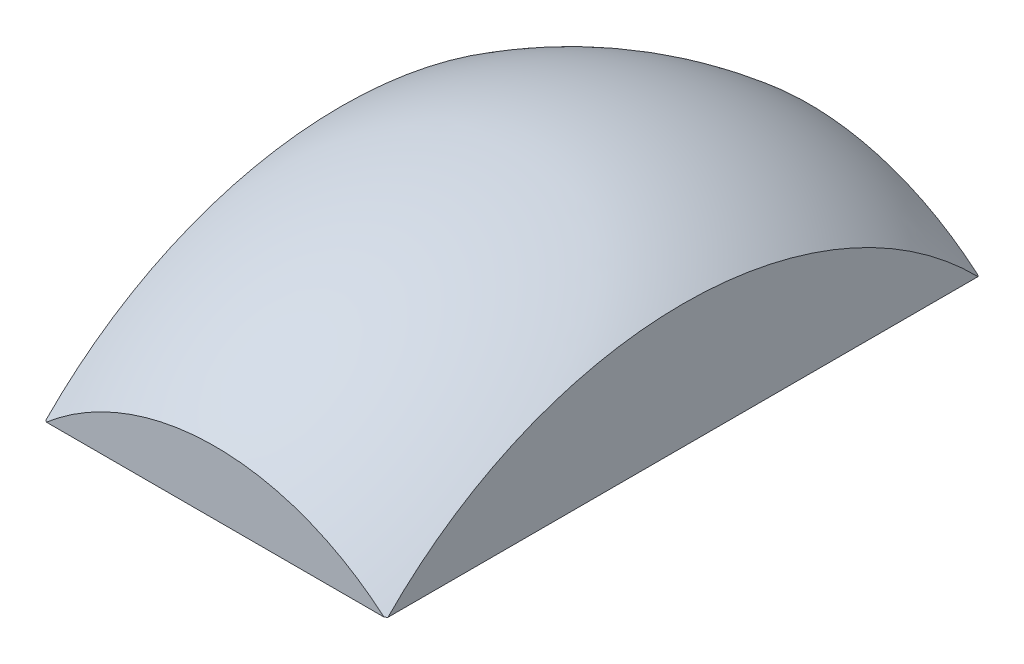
ISO-10303-21;
HEADER;
FILE_DESCRIPTION(('STEP AP214'),'2;1');
FILE_NAME('part.step','',(''),(''),'','','');
FILE_SCHEMA(('AUTOMOTIVE_DESIGN { 1 0 10303 214 1 1 1 1 }'));
ENDSEC;
DATA;
#1=APPLICATION_CONTEXT('core data for automotive mechanical design processes');
#2=APPLICATION_PROTOCOL_DEFINITION('international standard','automotive_design',2000,#1);
#3=PRODUCT_CONTEXT('',#1,'mechanical');
#4=PRODUCT('Part','Part','',(#3));
#5=PRODUCT_RELATED_PRODUCT_CATEGORY('part','',(#4));
#6=PRODUCT_DEFINITION_FORMATION('','',#4);
#7=PRODUCT_DEFINITION_CONTEXT('part definition',#1,'design');
#8=PRODUCT_DEFINITION('design','',#6,#7);
#9=PRODUCT_DEFINITION_SHAPE('','',#8);
#10=(LENGTH_UNIT() NAMED_UNIT(*) SI_UNIT(.MILLI.,.METRE.));
#11=(NAMED_UNIT(*) PLANE_ANGLE_UNIT() SI_UNIT($,.RADIAN.));
#12=(NAMED_UNIT(*) SI_UNIT($,.STERADIAN.) SOLID_ANGLE_UNIT());
#13=UNCERTAINTY_MEASURE_WITH_UNIT(LENGTH_MEASURE(1.E-05),#10,'distance_accuracy_value','');
#14=(GEOMETRIC_REPRESENTATION_CONTEXT(3) GLOBAL_UNCERTAINTY_ASSIGNED_CONTEXT((#13)) GLOBAL_UNIT_ASSIGNED_CONTEXT((#10,
#11,#12)) REPRESENTATION_CONTEXT('',''));
#15=CARTESIAN_POINT('',(0.,0.,0.));
#16=DIRECTION('',(0.,0.,1.));
#17=DIRECTION('',(1.,0.,0.));
#18=AXIS2_PLACEMENT_3D('',#15,#16,#17);
#19=CARTESIAN_POINT('',(-62.5,65.,108.5));
#20=DIRECTION('',(1.,0.,0.));
#21=DIRECTION('',(0.,1.,0.));
#22=AXIS2_PLACEMENT_3D('',#19,#20,#21);
#23=PLANE('',#22);
#24=CARTESIAN_POINT('',(-62.5,-105.625412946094,0.));
#25=DIRECTION('',(1.,0.,0.));
#26=DIRECTION('',(0.,0.,-1.));
#27=AXIS2_PLACEMENT_3D('',#24,#25,#26);
#28=CIRCLE('',#27,150.969374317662);
#29=CARTESIAN_POINT('',(-62.5,0.,-107.865768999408));
#30=VERTEX_POINT('',#29);
#31=CARTESIAN_POINT('',(-62.5,0.,107.865768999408));
#32=VERTEX_POINT('',#31);
#33=EDGE_CURVE('E57',#30,#32,#28,.T.);
#34=ORIENTED_EDGE('',*,*,#33,.F.);
#35=DIRECTION('',(0.,0.,-1.));
#36=VECTOR('',#35,1.);
#37=CARTESIAN_POINT('',(-62.5,0.,108.5));
#38=LINE('',#37,#36);
#39=EDGE_CURVE('E44',#32,#30,#38,.T.);
#40=ORIENTED_EDGE('',*,*,#39,.F.);
#41=EDGE_LOOP('',(#34,#40));
#42=FACE_BOUND('',#41,.T.);
#43=ADVANCED_FACE('F32',(#42),#23,.F.);
#44=CARTESIAN_POINT('',(-62.5,0.,108.5));
#45=DIRECTION('',(0.,1.,0.));
#46=DIRECTION('',(0.,0.,1.));
#47=AXIS2_PLACEMENT_3D('',#44,#45,#46);
#48=PLANE('',#47);
#49=CARTESIAN_POINT('',(105.910426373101,0.,0.));
#50=CARTESIAN_POINT('',(105.910428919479,0.,-2.38813620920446));
#51=CARTESIAN_POINT('',(105.866166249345,0.,-4.77629874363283));
#52=CARTESIAN_POINT('',(105.688526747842,0.,-9.54935461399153));
#53=CARTESIAN_POINT('',(105.555148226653,0.,-11.9342478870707));
#54=CARTESIAN_POINT('',(105.197502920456,0.,-16.6977261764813));
#55=CARTESIAN_POINT('',(104.973217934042,0.,-19.07630983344));
#56=CARTESIAN_POINT('',(104.431020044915,0.,-23.8227994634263));
#57=CARTESIAN_POINT('',(104.113108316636,0.,-26.1907055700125));
#58=CARTESIAN_POINT('',(103.381059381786,0.,-30.9053758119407));
#59=CARTESIAN_POINT('',(102.967173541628,0.,-33.2521788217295));
#60=CARTESIAN_POINT('',(102.038654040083,0.,-37.925909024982));
#61=CARTESIAN_POINT('',(101.524017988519,0.,-40.2528357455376));
#62=CARTESIAN_POINT('',(100.38992578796,0.,-44.8800449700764));
#63=CARTESIAN_POINT('',(99.7705133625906,0.,-47.1803381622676));
#64=CARTESIAN_POINT('',(98.4224536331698,0.,-51.7486330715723));
#65=CARTESIAN_POINT('',(97.6938166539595,0.,-54.0166378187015));
#66=CARTESIAN_POINT('',(96.3564117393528,0.,-57.8458057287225));
#67=CARTESIAN_POINT('',(95.7762364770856,0.,-59.4170031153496));
#68=CARTESIAN_POINT('',(94.5586879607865,0.,-62.5370632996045));
#69=CARTESIAN_POINT('',(93.9213170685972,0.,-64.0859270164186));
#70=CARTESIAN_POINT('',(92.5883669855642,0.,-67.1582744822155));
#71=CARTESIAN_POINT('',(91.8927924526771,0.,-68.6817602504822));
#72=CARTESIAN_POINT('',(90.4425352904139,0.,-71.7003866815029));
#73=CARTESIAN_POINT('',(89.6878520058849,0.,-73.1955270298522));
#74=CARTESIAN_POINT('',(88.1189412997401,0.,-76.1538677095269));
#75=CARTESIAN_POINT('',(87.3047261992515,0.,-77.6170745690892));
#76=CARTESIAN_POINT('',(85.6162943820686,0.,-80.5084355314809));
#77=CARTESIAN_POINT('',(84.7420790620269,0.,-81.9365904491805));
#78=CARTESIAN_POINT('',(82.9335280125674,0.,-84.7544537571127));
#79=CARTESIAN_POINT('',(81.9991890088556,0.,-86.1441600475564));
#80=CARTESIAN_POINT('',(80.0706843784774,0.,-88.8814576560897));
#81=CARTESIAN_POINT('',(79.0765186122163,0.,-90.2290488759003));
#82=CARTESIAN_POINT('',(77.0204647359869,0.,-92.8894236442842));
#83=CARTESIAN_POINT('',(75.9580846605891,0.,-94.201827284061));
#84=CARTESIAN_POINT('',(73.7740055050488,0.,-96.7763466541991));
#85=CARTESIAN_POINT('',(72.652306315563,0.,-98.0384622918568));
#86=CARTESIAN_POINT('',(70.3507974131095,0.,-100.508702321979));
#87=CARTESIAN_POINT('',(69.1709847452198,0.,-101.716823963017));
#88=CARTESIAN_POINT('',(66.7549171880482,0.,-104.075271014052));
#89=CARTESIAN_POINT('',(65.5186624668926,0.,-105.225596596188));
#90=CARTESIAN_POINT('',(62.9919604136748,0.,-107.464523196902));
#91=CARTESIAN_POINT('',(61.701525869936,0.,-108.553138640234));
#92=CARTESIAN_POINT('',(59.0684711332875,0.,-110.665375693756));
#93=CARTESIAN_POINT('',(57.7258504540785,0.,-111.688996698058));
#94=CARTESIAN_POINT('',(54.9912289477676,0.,-113.66766340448));
#95=CARTESIAN_POINT('',(53.5992341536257,0.,-114.622717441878));
#96=CARTESIAN_POINT('',(50.7686722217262,0.,-116.461076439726));
#97=CARTESIAN_POINT('',(49.3301067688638,0.,-117.344383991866));
#98=CARTESIAN_POINT('',(46.5935268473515,0.,-118.929639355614));
#99=CARTESIAN_POINT('',(45.3006195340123,0.,-119.640419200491));
#100=CARTESIAN_POINT('',(42.6840252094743,0.,-121.002868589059));
#101=CARTESIAN_POINT('',(41.3603386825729,0.,-121.654539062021));
#102=CARTESIAN_POINT('',(38.6847748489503,0.,-122.896917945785));
#103=CARTESIAN_POINT('',(37.3328996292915,0.,-123.487630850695));
#104=CARTESIAN_POINT('',(34.6034860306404,0.,-124.606497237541));
#105=CARTESIAN_POINT('',(33.2259474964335,0.,-125.134650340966));
#106=CARTESIAN_POINT('',(30.4486477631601,0.,-126.126654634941));
#107=CARTESIAN_POINT('',(29.0488975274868,0.,-126.590536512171));
#108=CARTESIAN_POINT('',(26.2294158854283,0.,-127.452966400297));
#109=CARTESIAN_POINT('',(24.8096846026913,0.,-127.851514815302));
#110=CARTESIAN_POINT('',(21.953265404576,0.,-128.582117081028));
#111=CARTESIAN_POINT('',(20.5165780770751,0.,-128.914173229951));
#112=CARTESIAN_POINT('',(17.6292791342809,0.,-129.510838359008));
#113=CARTESIAN_POINT('',(16.1786677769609,0.,-129.775448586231));
#114=CARTESIAN_POINT('',(13.3859624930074,0.,-130.21756768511));
#115=CARTESIAN_POINT('',(12.0447142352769,0.,-130.400436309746));
#116=CARTESIAN_POINT('',(9.35546690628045,0.,-130.708244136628));
#117=CARTESIAN_POINT('',(8.00746729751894,0.,-130.833178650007));
#118=CARTESIAN_POINT('',(5.30754399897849,0.,-131.024769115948));
#119=CARTESIAN_POINT('',(3.95562094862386,0.,-131.091434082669));
#120=CARTESIAN_POINT('',(1.25002546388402,0.,-131.166356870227));
#121=CARTESIAN_POINT('',(-0.103647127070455,0.,-131.174609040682));
#122=CARTESIAN_POINT('',(-2.80970197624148,0.,-131.132676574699));
#123=CARTESIAN_POINT('',(-4.16208449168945,0.,-131.082508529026));
#124=CARTESIAN_POINT('',(-6.86356004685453,0.,-130.923879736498));
#125=CARTESIAN_POINT('',(-8.21265274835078,0.,-130.815413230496));
#126=CARTESIAN_POINT('',(-10.9047813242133,0.,-130.54046631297));
#127=CARTESIAN_POINT('',(-12.2478177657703,0.,-130.37399145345));
#128=CARTESIAN_POINT('',(-14.9256141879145,0.,-129.983419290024));
#129=CARTESIAN_POINT('',(-16.2603733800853,0.,-129.759316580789));
#130=CARTESIAN_POINT('',(-18.8895712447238,0.,-129.259650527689));
#131=CARTESIAN_POINT('',(-20.1842478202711,0.,-128.985338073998));
#132=CARTESIAN_POINT('',(-22.7611044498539,0.,-128.382773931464));
#133=CARTESIAN_POINT('',(-24.0432833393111,0.,-128.054517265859));
#134=CARTESIAN_POINT('',(-26.5927038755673,0.,-127.344877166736));
#135=CARTESIAN_POINT('',(-27.8599474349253,0.,-126.963500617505));
#136=CARTESIAN_POINT('',(-30.377548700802,0.,-126.148495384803));
#137=CARTESIAN_POINT('',(-31.6279044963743,0.,-125.714860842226));
#138=CARTESIAN_POINT('',(-35.3503096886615,0.,-124.337033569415));
#139=CARTESIAN_POINT('',(-37.7945000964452,0.,-123.315693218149));
#140=CARTESIAN_POINT('',(-41.3912851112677,0.,-121.637179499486));
#141=CARTESIAN_POINT('',(-42.5787839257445,0.,-121.053169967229));
#142=CARTESIAN_POINT('',(-44.9291462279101,0.,-119.837511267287));
#143=CARTESIAN_POINT('',(-46.0920117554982,0.,-119.205866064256));
#144=CARTESIAN_POINT('',(-48.4147682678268,0.,-117.883002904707));
#145=CARTESIAN_POINT('',(-49.5741169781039,0.,-117.190834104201));
#146=CARTESIAN_POINT('',(-51.8636040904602,0.,-115.759961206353));
#147=CARTESIAN_POINT('',(-52.9937448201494,0.,-115.021260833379));
#148=CARTESIAN_POINT('',(-55.2234174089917,0.,-113.498862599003));
#149=CARTESIAN_POINT('',(-56.3229469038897,0.,-112.715161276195));
#150=CARTESIAN_POINT('',(-58.4897757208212,0.,-111.104590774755));
#151=CARTESIAN_POINT('',(-59.5570776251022,0.,-110.277725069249));
#152=CARTESIAN_POINT('',(-61.6584768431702,0.,-108.5823413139));
#153=CARTESIAN_POINT('',(-62.6925662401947,0.,-107.713813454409));
#154=CARTESIAN_POINT('',(-64.7260188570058,0.,-105.937178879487));
#155=CARTESIAN_POINT('',(-65.7253846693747,0.,-105.02907513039));
#156=CARTESIAN_POINT('',(-67.6885255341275,0.,-103.175002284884));
#157=CARTESIAN_POINT('',(-68.6522970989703,0.,-102.229029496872));
#158=CARTESIAN_POINT('',(-70.5431775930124,0.,-100.301266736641));
#159=CARTESIAN_POINT('',(-71.4702889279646,0.,-99.3194791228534));
#160=CARTESIAN_POINT('',(-73.3475041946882,0.,-97.2555916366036));
#161=CARTESIAN_POINT('',(-74.2950455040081,0.,-96.1711602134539));
#162=CARTESIAN_POINT('',(-76.1468718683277,0.,-93.9660399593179));
#163=CARTESIAN_POINT('',(-77.0511579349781,0.,-92.8453519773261));
#164=CARTESIAN_POINT('',(-78.8158934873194,0.,-90.5700827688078));
#165=CARTESIAN_POINT('',(-79.6763451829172,0.,-89.4155032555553));
#166=CARTESIAN_POINT('',(-81.3531838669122,0.,-87.0745661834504));
#167=CARTESIAN_POINT('',(-82.1695650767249,0.,-85.8882044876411));
#168=CARTESIAN_POINT('',(-83.7576715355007,0.,-83.4865341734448));
#169=CARTESIAN_POINT('',(-84.5294113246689,0.,-82.2712351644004));
#170=CARTESIAN_POINT('',(-86.0285440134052,0.,-79.8134675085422));
#171=CARTESIAN_POINT('',(-86.7559332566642,0.,-78.5709966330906));
#172=CARTESIAN_POINT('',(-88.1665101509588,0.,-76.0610110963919));
#173=CARTESIAN_POINT('',(-88.8496921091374,0.,-74.7934932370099));
#174=CARTESIAN_POINT('',(-90.1720397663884,0.,-72.2356833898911));
#175=CARTESIAN_POINT('',(-90.8112037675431,0.,-70.9453905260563));
#176=CARTESIAN_POINT('',(-92.3125187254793,0.,-67.7824084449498));
#177=CARTESIAN_POINT('',(-93.1517855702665,0.,-65.8988122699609));
#178=CARTESIAN_POINT('',(-94.7423566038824,0.,-62.0953873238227));
#179=CARTESIAN_POINT('',(-95.4936774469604,0.,-60.1755654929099));
#180=CARTESIAN_POINT('',(-96.9109793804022,0.,-56.3038720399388));
#181=CARTESIAN_POINT('',(-97.5769271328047,0.,-54.3519882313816));
#182=CARTESIAN_POINT('',(-98.8256423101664,0.,-50.4217407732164));
#183=CARTESIAN_POINT('',(-99.4084053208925,0.,-48.4433757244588));
#184=CARTESIAN_POINT('',(-100.495264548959,0.,-44.4579842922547));
#185=CARTESIAN_POINT('',(-100.999086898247,0.,-42.4508833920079));
#186=CARTESIAN_POINT('',(-101.928504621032,0.,-38.4187417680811));
#187=CARTESIAN_POINT('',(-102.35410150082,0.,-36.3937013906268));
#188=CARTESIAN_POINT('',(-103.129881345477,0.,-32.3292951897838));
#189=CARTESIAN_POINT('',(-103.480065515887,0.,-30.2899295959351));
#190=CARTESIAN_POINT('',(-104.107660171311,0.,-26.2000090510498));
#191=CARTESIAN_POINT('',(-104.385067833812,0.,-24.1494536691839));
#192=CARTESIAN_POINT('',(-104.935527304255,0.,-19.4792250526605));
#193=CARTESIAN_POINT('',(-105.1867293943,0.,-16.856957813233));
#194=CARTESIAN_POINT('',(-105.578712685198,0.,-11.6041334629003));
#195=CARTESIAN_POINT('',(-105.719487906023,0.,-8.97357591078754));
#196=CARTESIAN_POINT('',(-105.89286571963,0.,-3.70788156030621));
#197=CARTESIAN_POINT('',(-105.925426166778,0.,-1.07274337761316));
#198=CARTESIAN_POINT('',(-105.882789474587,0.,4.19660756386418));
#199=CARTESIAN_POINT('',(-105.807594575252,0.,6.83082034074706));
#200=CARTESIAN_POINT('',(-105.548418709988,0.,12.0900472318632));
#201=CARTESIAN_POINT('',(-105.3645976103,0.,14.7150691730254));
#202=CARTESIAN_POINT('',(-104.885448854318,0.,19.9550341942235));
#203=CARTESIAN_POINT('',(-104.590118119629,0.,22.5699769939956));
#204=CARTESIAN_POINT('',(-103.883902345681,0.,27.78294871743));
#205=CARTESIAN_POINT('',(-103.473077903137,0.,30.3809857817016));
#206=CARTESIAN_POINT('',(-102.530722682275,0.,35.5547280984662));
#207=CARTESIAN_POINT('',(-101.999203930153,0.,38.1304355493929));
#208=CARTESIAN_POINT('',(-100.583981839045,0.,44.2240598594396));
#209=CARTESIAN_POINT('',(-99.643149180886,0.,47.7290818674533));
#210=CARTESIAN_POINT('',(-98.0403397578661,0.,52.926835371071));
#211=CARTESIAN_POINT('',(-97.4740926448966,0.,54.6495859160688));
#212=CARTESIAN_POINT('',(-96.275967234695,0.,58.0720581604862));
#213=CARTESIAN_POINT('',(-95.6440953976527,0.,59.7717821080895));
#214=CARTESIAN_POINT('',(-94.3143340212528,0.,63.1417460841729));
#215=CARTESIAN_POINT('',(-93.616563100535,0.,64.8120329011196));
#216=CARTESIAN_POINT('',(-92.1528301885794,0.,68.1223125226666));
#217=CARTESIAN_POINT('',(-91.3868747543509,0.,69.762308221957));
#218=CARTESIAN_POINT('',(-89.7857582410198,0.,73.008096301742));
#219=CARTESIAN_POINT('',(-88.9506004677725,0.,74.6138903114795));
#220=CARTESIAN_POINT('',(-87.210396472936,0.,77.7871444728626));
#221=CARTESIAN_POINT('',(-86.3053528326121,0.,79.354606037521));
#222=CARTESIAN_POINT('',(-84.5716898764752,0.,82.2057716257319));
#223=CARTESIAN_POINT('',(-83.7531538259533,0.,83.4956156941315));
#224=CARTESIAN_POINT('',(-82.0661419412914,0.,86.0422113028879));
#225=CARTESIAN_POINT('',(-81.1976674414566,0.,87.2989637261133));
#226=CARTESIAN_POINT('',(-79.4110850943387,0.,89.7765778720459));
#227=CARTESIAN_POINT('',(-78.4929803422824,0.,90.9974418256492));
#228=CARTESIAN_POINT('',(-76.6075636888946,0.,93.4005994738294));
#229=CARTESIAN_POINT('',(-75.6402514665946,0.,94.5828929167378));
#230=CARTESIAN_POINT('',(-73.6567299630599,0.,96.9065877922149));
#231=CARTESIAN_POINT('',(-72.6405007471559,0.,98.0479722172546));
#232=CARTESIAN_POINT('',(-70.5604744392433,0.,100.286527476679));
#233=CARTESIAN_POINT('',(-69.496678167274,0.,101.383699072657));
#234=CARTESIAN_POINT('',(-67.322632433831,0.,103.531123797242));
#235=CARTESIAN_POINT('',(-66.2123810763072,0.,104.581375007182));
#236=CARTESIAN_POINT('',(-63.9468715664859,0.,106.632182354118));
#237=CARTESIAN_POINT('',(-62.7916133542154,0.,107.63273842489));
#238=CARTESIAN_POINT('',(-60.4318673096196,0.,109.58633341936));
#239=CARTESIAN_POINT('',(-59.2271631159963,0.,110.539111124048));
#240=CARTESIAN_POINT('',(-56.7758351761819,0.,112.389146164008));
#241=CARTESIAN_POINT('',(-55.5292113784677,0.,113.286403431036));
#242=CARTESIAN_POINT('',(-52.9961117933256,0.,115.02289048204));
#243=CARTESIAN_POINT('',(-51.7096347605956,0.,115.862118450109));
#244=CARTESIAN_POINT('',(-49.0991865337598,0.,117.480097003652));
#245=CARTESIAN_POINT('',(-47.7752154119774,0.,118.258847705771));
#246=CARTESIAN_POINT('',(-45.0927256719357,0.,119.753350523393));
#247=CARTESIAN_POINT('',(-43.7342182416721,0.,120.469122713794));
#248=CARTESIAN_POINT('',(-40.9849582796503,0.,121.83581439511));
#249=CARTESIAN_POINT('',(-39.5942058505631,0.,122.486734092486));
#250=CARTESIAN_POINT('',(-36.7834410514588,0.,123.721710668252));
#251=CARTESIAN_POINT('',(-35.3634308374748,0.,124.305772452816));
#252=CARTESIAN_POINT('',(-32.4971109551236,0.,125.405293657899));
#253=CARTESIAN_POINT('',(-31.0508018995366,0.,125.920754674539));
#254=CARTESIAN_POINT('',(-28.271756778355,0.,126.836452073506));
#255=CARTESIAN_POINT('',(-26.9410832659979,0.,127.242960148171));
#256=CARTESIAN_POINT('',(-24.2630844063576,0.,127.997331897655));
#257=CARTESIAN_POINT('',(-22.9157577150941,0.,128.345190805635));
#258=CARTESIAN_POINT('',(-20.2073181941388,0.,128.981272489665));
#259=CARTESIAN_POINT('',(-18.8462075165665,0.,129.269504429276));
#260=CARTESIAN_POINT('',(-16.1124581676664,0.,129.785678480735));
#261=CARTESIAN_POINT('',(-14.7398183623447,0.,130.013614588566));
#262=CARTESIAN_POINT('',(-11.986238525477,0.,130.408501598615));
#263=CARTESIAN_POINT('',(-10.6053012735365,0.,130.575471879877));
#264=CARTESIAN_POINT('',(-7.83738134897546,0.,130.848092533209));
#265=CARTESIAN_POINT('',(-6.45039865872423,0.,130.953742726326));
#266=CARTESIAN_POINT('',(-3.67313671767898,0.,131.103444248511));
#267=CARTESIAN_POINT('',(-2.28285752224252,0.,131.147496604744));
#268=CARTESIAN_POINT('',(0.498288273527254,0.,131.17388951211));
#269=CARTESIAN_POINT('',(1.8891548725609,0.,131.156230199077));
#270=CARTESIAN_POINT('',(4.60689756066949,0.,131.061405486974));
#271=CARTESIAN_POINT('',(5.93386800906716,0.,130.986922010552));
#272=CARTESIAN_POINT('',(8.58357889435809,0.,130.781826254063));
#273=CARTESIAN_POINT('',(9.90631896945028,0.,130.651209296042));
#274=CARTESIAN_POINT('',(12.5449198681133,0.,130.334178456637));
#275=CARTESIAN_POINT('',(13.8607815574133,0.,130.147771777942));
#276=CARTESIAN_POINT('',(16.4835887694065,0.,129.71958004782));
#277=CARTESIAN_POINT('',(17.7905334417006,0.,129.477789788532));
#278=CARTESIAN_POINT('',(20.3928272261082,0.,128.939467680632));
#279=CARTESIAN_POINT('',(21.6881785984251,0.,128.642946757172));
#280=CARTESIAN_POINT('',(24.2654161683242,0.,127.995805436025));
#281=CARTESIAN_POINT('',(25.5473010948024,0.,127.64517997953));
#282=CARTESIAN_POINT('',(28.095209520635,0.,126.890691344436));
#283=CARTESIAN_POINT('',(29.3612343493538,0.,126.486832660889));
#284=CARTESIAN_POINT('',(31.8754274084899,0.,125.626807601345));
#285=CARTESIAN_POINT('',(33.1235939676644,0.,125.170636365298));
#286=CARTESIAN_POINT('',(36.8427670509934,0.,123.72337718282));
#287=CARTESIAN_POINT('',(39.2841405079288,0.,122.654821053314));
#288=CARTESIAN_POINT('',(44.070822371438,0.,120.321669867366));
#289=CARTESIAN_POINT('',(46.4161314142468,0.,119.057076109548));
#290=CARTESIAN_POINT('',(50.9973562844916,0.,116.342907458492));
#291=CARTESIAN_POINT('',(53.2332651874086,0.,114.893320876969));
#292=CARTESIAN_POINT('',(57.5832955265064,0.,111.82182007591));
#293=CARTESIAN_POINT('',(59.6974136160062,0.,110.199901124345));
#294=CARTESIAN_POINT('',(63.8837919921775,0.,106.722400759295));
#295=CARTESIAN_POINT('',(65.9501197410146,0.,104.859679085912));
#296=CARTESIAN_POINT('',(69.9296294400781,0.,100.977454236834));
#297=CARTESIAN_POINT('',(71.8428080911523,0.,98.9579476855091));
#298=CARTESIAN_POINT('',(75.509472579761,0.,94.7787051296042));
#299=CARTESIAN_POINT('',(77.2629440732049,0.,92.6189565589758));
#300=CARTESIAN_POINT('',(80.6058642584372,0.,88.1762039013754));
#301=CARTESIAN_POINT('',(82.1953063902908,0.,85.8931948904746));
#302=CARTESIAN_POINT('',(85.3591168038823,0.,80.9867680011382));
#303=CARTESIAN_POINT('',(86.9160918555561,0.,78.3521363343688));
#304=CARTESIAN_POINT('',(89.8304058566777,0.,72.9749353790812));
#305=CARTESIAN_POINT('',(91.1877346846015,0.,70.2323606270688));
#306=CARTESIAN_POINT('',(93.7071067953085,0.,64.658217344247));
#307=CARTESIAN_POINT('',(94.869093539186,0.,61.82662332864));
#308=CARTESIAN_POINT('',(97.0037805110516,0.,56.093232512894));
#309=CARTESIAN_POINT('',(97.9764653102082,0.,53.1914300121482));
#310=CARTESIAN_POINT('',(100.080795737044,0.,46.2042719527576));
#311=CARTESIAN_POINT('',(101.129323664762,0.,42.0936200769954));
#312=CARTESIAN_POINT('',(102.459442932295,0.,35.8769796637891));
#313=CARTESIAN_POINT('',(102.862439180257,0.,33.795809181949));
#314=CARTESIAN_POINT('',(103.590553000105,0.,29.6197719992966));
#315=CARTESIAN_POINT('',(103.915671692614,0.,27.5249054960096));
#316=CARTESIAN_POINT('',(104.491437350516,0.,23.3193730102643));
#317=CARTESIAN_POINT('',(104.741883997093,0.,21.2086798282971));
#318=CARTESIAN_POINT('',(105.169453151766,0.,16.9798914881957));
#319=CARTESIAN_POINT('',(105.346575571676,0.,14.8617963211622));
#320=CARTESIAN_POINT('',(105.629234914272,0.,10.62092550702));
#321=CARTESIAN_POINT('',(105.734774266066,0.,8.49815002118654));
#322=CARTESIAN_POINT('',(105.875369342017,0.,4.25025665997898));
#323=CARTESIAN_POINT('',(105.910424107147,0.,2.12513875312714));
#324=CARTESIAN_POINT('',(105.910426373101,0.,0.));
#325=B_SPLINE_CURVE_WITH_KNOTS('',3,(#49,#50,#51,#52,#53,#54,#55,#56,#57,#58,#59,#60,#61,#62,
#63,#64,#65,#66,#67,#68,#69,#70,#71,#72,#73,#74,#75,#76,#77,#78,#79,#80,#81,#82,#83,#84,#85,#86,
#87,#88,#89,#90,#91,#92,#93,#94,#95,#96,#97,#98,#99,#100,#101,#102,#103,#104,#105,#106,#107,
#108,#109,#110,#111,#112,#113,#114,#115,#116,#117,#118,#119,#120,#121,#122,#123,#124,#125,#126,
#127,#128,#129,#130,#131,#132,#133,#134,#135,#136,#137,#138,#139,#140,#141,#142,#143,#144,#145,
#146,#147,#148,#149,#150,#151,#152,#153,#154,#155,#156,#157,#158,#159,#160,#161,#162,#163,#164,
#165,#166,#167,#168,#169,#170,#171,#172,#173,#174,#175,#176,#177,#178,#179,#180,#181,#182,#183,
#184,#185,#186,#187,#188,#189,#190,#191,#192,#193,#194,#195,#196,#197,#198,#199,#200,#201,#202,
#203,#204,#205,#206,#207,#208,#209,#210,#211,#212,#213,#214,#215,#216,#217,#218,#219,#220,#221,
#222,#223,#224,#225,#226,#227,#228,#229,#230,#231,#232,#233,#234,#235,#236,#237,#238,#239,#240,
#241,#242,#243,#244,#245,#246,#247,#248,#249,#250,#251,#252,#253,#254,#255,#256,#257,#258,#259,
#260,#261,#262,#263,#264,#265,#266,#267,#268,#269,#270,#271,#272,#273,#274,#275,#276,#277,#278,
#279,#280,#281,#282,#283,#284,#285,#286,#287,#288,#289,#290,#291,#292,#293,#294,#295,#296,#297,
#298,#299,#300,#301,#302,#303,#304,#305,#306,#307,#308,#309,#310,#311,#312,#313,#314,#315,#316,
#317,#318,#319,#320,#321,#322,#323,#324),.UNSPECIFIED.,.T.,.F.,(4,2,2,2,2,2,2,2,2,2,2,2,2,2,2,2,
2,2,2,2,2,2,2,2,2,2,2,2,2,2,2,2,2,2,2,2,2,2,2,2,2,2,2,2,2,2,2,2,2,2,2,2,2,2,2,2,2,2,2,2,2,2,2,2,
2,2,2,2,2,2,2,2,2,2,2,2,2,2,2,2,2,2,2,2,2,2,2,2,2,2,2,2,2,2,2,2,2,2,2,2,2,2,2,2,2,2,2,2,2,2,2,2,
2,2,2,2,2,2,2,2,2,2,2,2,2,2,2,2,2,2,2,2,2,2,2,2,2,4),(0.,7.16404019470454,14.3282162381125,
21.4938274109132,28.6593487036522,35.8063105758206,42.9534420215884,50.0975982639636,
57.2410796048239,62.2647413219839,67.2881956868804,72.311248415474,77.3343568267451,
82.3564285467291,87.3783834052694,92.4006119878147,97.4228522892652,102.486616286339,
107.550389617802,112.614420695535,117.678436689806,122.741264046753,127.804138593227,
132.8663966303,137.9284717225,142.353229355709,146.777917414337,151.202279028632,
155.626667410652,160.048936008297,164.471177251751,168.893265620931,173.315272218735,
177.3750099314,181.43507615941,185.494514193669,189.554344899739,193.613022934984,
197.67210198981,201.730792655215,205.789864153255,209.75895532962,213.72841289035,
217.697356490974,221.666745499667,229.6030292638,233.572231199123,237.541103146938,
241.590755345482,245.640083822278,249.689724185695,253.7390392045,257.789312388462,
261.839282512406,265.88964840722,269.939748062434,274.25884446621,278.577839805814,
282.896617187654,287.215959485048,291.533886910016,295.852169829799,300.171007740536,
304.490012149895,310.673922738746,316.856660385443,323.041805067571,329.227277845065,
335.433756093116,341.640114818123,347.846374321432,354.052874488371,361.953177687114,
369.853908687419,377.757716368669,385.661359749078,393.553400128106,401.445658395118,
409.333783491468,417.221122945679,428.097881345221,433.53709147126,438.975766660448,
444.404832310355,449.833376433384,455.261661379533,460.689745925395,465.271568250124,
469.853268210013,474.434682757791,479.016127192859,483.599454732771,488.182703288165,
492.766139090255,497.349581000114,501.955830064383,506.562084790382,511.168483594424,
515.774873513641,520.37978974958,524.984691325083,529.589254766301,534.193711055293,
538.36654864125,542.539725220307,546.712259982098,550.8852100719,555.056832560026,
559.228467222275,563.400032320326,567.571588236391,571.557582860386,575.543909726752,
579.529722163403,583.515909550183,587.50130208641,591.487067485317,595.472496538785,
599.458296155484,607.443329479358,615.428309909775,623.413795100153,631.399499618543,
639.736500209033,648.073680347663,656.411608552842,664.749870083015,673.921742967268,
683.094080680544,692.269068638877,701.444804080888,714.155396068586,720.513791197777,
726.872094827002,733.24730516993,739.622523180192,745.997524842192,752.372613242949),.UNSPECIFIED.);
#326=CARTESIAN_POINT('',(62.5,0.,-107.865768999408));
#327=VERTEX_POINT('',#326);
#328=CARTESIAN_POINT('',(61.7438344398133,0.,-108.5));
#329=VERTEX_POINT('',#328);
#330=EDGE_CURVE('E50',#327,#329,#325,.T.);
#331=ORIENTED_EDGE('',*,*,#330,.F.);
#332=DIRECTION('',(0.,0.,-1.));
#333=VECTOR('',#332,1.);
#334=CARTESIAN_POINT('',(62.5,0.,108.5));
#335=LINE('',#334,#333);
#336=CARTESIAN_POINT('',(62.5,0.,107.865768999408));
#337=VERTEX_POINT('',#336);
#338=EDGE_CURVE('E89',#337,#327,#335,.T.);
#339=ORIENTED_EDGE('',*,*,#338,.F.);
#340=CARTESIAN_POINT('',(61.7438344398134,7.08150140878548E-12,108.5));
#341=VERTEX_POINT('',#340);
#342=EDGE_CURVE('E91',#341,#337,#325,.T.);
#343=ORIENTED_EDGE('',*,*,#342,.F.);
#344=DIRECTION('',(1.,0.,0.));
#345=VECTOR('',#344,1.);
#346=CARTESIAN_POINT('',(-62.5,0.,108.5));
#347=LINE('',#346,#345);
#348=CARTESIAN_POINT('',(-61.7438344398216,0.,108.5));
#349=VERTEX_POINT('',#348);
#350=EDGE_CURVE('E86',#349,#341,#347,.T.);
#351=ORIENTED_EDGE('',*,*,#350,.F.);
#352=EDGE_CURVE('E83',#32,#349,#325,.T.);
#353=ORIENTED_EDGE('',*,*,#352,.F.);
#354=ORIENTED_EDGE('',*,*,#39,.T.);
#355=CARTESIAN_POINT('',(-61.7438344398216,0.,-108.5));
#356=VERTEX_POINT('',#355);
#357=EDGE_CURVE('E74',#356,#30,#325,.T.);
#358=ORIENTED_EDGE('',*,*,#357,.F.);
#359=DIRECTION('',(1.,0.,0.));
#360=VECTOR('',#359,1.);
#361=CARTESIAN_POINT('',(-62.5,0.,-108.5));
#362=LINE('',#361,#360);
#363=EDGE_CURVE('E81',#356,#329,#362,.T.);
#364=ORIENTED_EDGE('',*,*,#363,.T.);
#365=EDGE_LOOP('',(#331,#339,#343,#351,#353,#354,#358,#364));
#366=FACE_BOUND('',#365,.T.);
#367=ADVANCED_FACE('F80',(#366),#48,.F.);
#368=CARTESIAN_POINT('',(62.5,0.,108.5));
#369=DIRECTION('',(-1.,0.,0.));
#370=DIRECTION('',(0.,-1.,0.));
#371=AXIS2_PLACEMENT_3D('',#368,#369,#370);
#372=PLANE('',#371);
#373=CARTESIAN_POINT('',(62.5,-105.625412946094,0.));
#374=DIRECTION('',(1.,0.,0.));
#375=DIRECTION('',(0.,0.,-1.));
#376=AXIS2_PLACEMENT_3D('',#373,#374,#375);
#377=CIRCLE('',#376,150.969374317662);
#378=EDGE_CURVE('E102',#327,#337,#377,.T.);
#379=ORIENTED_EDGE('',*,*,#378,.T.);
#380=ORIENTED_EDGE('',*,*,#338,.T.);
#381=EDGE_LOOP('',(#379,#380));
#382=FACE_BOUND('',#381,.T.);
#383=ADVANCED_FACE('F101',(#382),#372,.F.);
#384=CARTESIAN_POINT('',(62.5,65.,108.5));
#385=DIRECTION('',(0.,0.,1.));
#386=DIRECTION('',(1.,0.,0.));
#387=AXIS2_PLACEMENT_3D('',#384,#385,#386);
#388=PLANE('',#387);
#389=ORIENTED_EDGE('',*,*,#350,.T.);
#390=CARTESIAN_POINT('',(0.,23.1717760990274,108.5));
#391=CARTESIAN_POINT('',(1.33646541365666,23.1717760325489,108.5));
#392=CARTESIAN_POINT('',(2.67292918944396,23.1427515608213,108.5));
#393=CARTESIAN_POINT('',(5.34346252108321,23.0267250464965,108.5));
#394=CARTESIAN_POINT('',(6.67753183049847,22.9397173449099,108.5));
#395=CARTESIAN_POINT('',(9.34051286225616,22.7079442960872,108.5));
#396=CARTESIAN_POINT('',(10.6694251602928,22.5631855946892,108.5));
#397=CARTESIAN_POINT('',(13.3197770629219,22.2162961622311,108.5));
#398=CARTESIAN_POINT('',(14.6412159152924,22.0141597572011,108.5));
#399=CARTESIAN_POINT('',(18.5903007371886,21.3224132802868,108.5));
#400=CARTESIAN_POINT('',(21.2035228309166,20.7473953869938,108.5));
#401=CARTESIAN_POINT('',(26.3706356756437,19.3755481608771,108.5));
#402=CARTESIAN_POINT('',(28.9245261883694,18.5787179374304,108.5));
#403=CARTESIAN_POINT('',(33.951630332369,16.7724685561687,108.5));
#404=CARTESIAN_POINT('',(36.424960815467,15.7633747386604,108.5));
#405=CARTESIAN_POINT('',(41.278322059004,13.5416749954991,108.5));
#406=CARTESIAN_POINT('',(43.6583532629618,12.3290700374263,108.5));
#407=CARTESIAN_POINT('',(48.3103168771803,9.71176653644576,108.5));
#408=CARTESIAN_POINT('',(50.5822462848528,8.30706266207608,108.5));
#409=CARTESIAN_POINT('',(55.004901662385,5.31845516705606,108.5));
#410=CARTESIAN_POINT('',(57.1556256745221,3.73454865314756,108.5));
#411=CARTESIAN_POINT('',(61.3679006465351,0.367105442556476,108.5));
#412=CARTESIAN_POINT('',(63.4266946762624,-1.41987698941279,108.5));
#413=CARTESIAN_POINT('',(67.3971513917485,-5.15020331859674,108.5));
#414=CARTESIAN_POINT('',(69.3088133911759,-7.09354794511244,108.5));
#415=CARTESIAN_POINT('',(72.9780627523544,-11.1203657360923,108.5));
#416=CARTESIAN_POINT('',(74.7356523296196,-13.2038368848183,108.5));
#417=CARTESIAN_POINT('',(78.0923425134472,-17.4946336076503,108.5));
#418=CARTESIAN_POINT('',(79.691435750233,-19.7019649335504,108.5));
#419=CARTESIAN_POINT('',(82.8807319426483,-24.4503643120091,108.5));
#420=CARTESIAN_POINT('',(84.4540903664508,-27.0027443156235,108.5));
#421=CARTESIAN_POINT('',(87.4066279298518,-32.2171985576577,108.5));
#422=CARTESIAN_POINT('',(88.7857989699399,-34.8792773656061,108.5));
#423=CARTESIAN_POINT('',(91.3536643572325,-40.2949773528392,108.5));
#424=CARTESIAN_POINT('',(92.5422697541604,-43.0486405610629,108.5));
#425=CARTESIAN_POINT('',(94.7338621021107,-48.6290298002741,108.5));
#426=CARTESIAN_POINT('',(95.7368282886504,-51.4557639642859,108.5));
#427=CARTESIAN_POINT('',(97.3549310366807,-56.5122746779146,108.5));
#428=CARTESIAN_POINT('',(98.0062909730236,-58.7305855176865,108.5));
#429=CARTESIAN_POINT('',(99.2066265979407,-63.1949664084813,108.5));
#430=CARTESIAN_POINT('',(99.7555919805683,-65.4410392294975,108.5));
#431=CARTESIAN_POINT('',(100.755024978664,-69.9558900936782,108.5));
#432=CARTESIAN_POINT('',(101.205451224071,-72.2246772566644,108.5));
#433=CARTESIAN_POINT('',(102.011166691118,-76.7789696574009,108.5));
#434=CARTESIAN_POINT('',(102.366458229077,-79.0644744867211,108.5));
#435=CARTESIAN_POINT('',(102.986207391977,-83.6553428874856,108.5));
#436=CARTESIAN_POINT('',(103.250363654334,-85.9607469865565,108.5));
#437=CARTESIAN_POINT('',(103.688935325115,-90.5800568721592,108.5));
#438=CARTESIAN_POINT('',(103.86335009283,-92.8939627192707,108.5));
#439=CARTESIAN_POINT('',(104.124337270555,-97.526410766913,108.5));
#440=CARTESIAN_POINT('',(104.210920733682,-99.844952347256,108.5));
#441=CARTESIAN_POINT('',(104.297276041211,-104.483645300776,108.5));
#442=CARTESIAN_POINT('',(104.297047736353,-106.803796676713,108.5));
#443=CARTESIAN_POINT('',(104.208663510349,-111.501756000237,108.5));
#444=CARTESIAN_POINT('',(104.11826076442,-113.879522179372,108.5));
#445=CARTESIAN_POINT('',(103.845061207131,-118.629776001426,108.5));
#446=CARTESIAN_POINT('',(103.662263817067,-121.002263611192,108.5));
#447=CARTESIAN_POINT('',(103.202127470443,-125.738486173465,108.5));
#448=CARTESIAN_POINT('',(102.924773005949,-128.102219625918,108.5));
#449=CARTESIAN_POINT('',(102.272559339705,-132.816227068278,108.5));
#450=CARTESIAN_POINT('',(101.897701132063,-135.166501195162,108.5));
#451=CARTESIAN_POINT('',(101.048303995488,-139.840783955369,108.5));
#452=CARTESIAN_POINT('',(100.574108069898,-142.164854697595,108.5));
#453=CARTESIAN_POINT('',(99.5212848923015,-146.789372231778,108.5));
#454=CARTESIAN_POINT('',(98.9426549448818,-149.089818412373,108.5));
#455=CARTESIAN_POINT('',(97.6771714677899,-153.6597192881,108.5));
#456=CARTESIAN_POINT('',(96.9903660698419,-155.929187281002,108.5));
#457=CARTESIAN_POINT('',(95.5044470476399,-160.430980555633,108.5));
#458=CARTESIAN_POINT('',(94.7053453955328,-162.66330976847,108.5));
#459=CARTESIAN_POINT('',(93.260879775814,-166.388023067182,108.5));
#460=CARTESIAN_POINT('',(92.6461830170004,-167.892360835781,108.5));
#461=CARTESIAN_POINT('',(91.3614180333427,-170.877187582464,108.5));
#462=CARTESIAN_POINT('',(90.6913522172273,-172.357677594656,108.5));
#463=CARTESIAN_POINT('',(89.295123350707,-175.291798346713,108.5));
#464=CARTESIAN_POINT('',(88.5689659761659,-176.745431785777,108.5));
#465=CARTESIAN_POINT('',(87.0599003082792,-179.622990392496,108.5));
#466=CARTESIAN_POINT('',(86.2769912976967,-181.046915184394,108.5));
#467=CARTESIAN_POINT('',(84.654107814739,-183.86182740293,108.5));
#468=CARTESIAN_POINT('',(83.8141353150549,-185.252815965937,108.5));
#469=CARTESIAN_POINT('',(82.0770201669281,-187.998610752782,108.5));
#470=CARTESIAN_POINT('',(81.1798787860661,-189.353417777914,108.5));
#471=CARTESIAN_POINT('',(79.3285256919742,-192.023606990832,108.5));
#472=CARTESIAN_POINT('',(78.3743106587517,-193.338986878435,108.5));
#473=CARTESIAN_POINT('',(76.4093119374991,-195.926825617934,108.5));
#474=CARTESIAN_POINT('',(75.3985281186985,-197.199284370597,108.5));
#475=CARTESIAN_POINT('',(73.3131117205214,-199.707486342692,108.5));
#476=CARTESIAN_POINT('',(72.2380458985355,-200.942869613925,108.5));
#477=CARTESIAN_POINT('',(70.03231294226,-203.362993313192,108.5));
#478=CARTESIAN_POINT('',(68.9016457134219,-204.547733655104,108.5));
#479=CARTESIAN_POINT('',(66.5860574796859,-206.863093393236,108.5));
#480=CARTESIAN_POINT('',(65.4011339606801,-207.993710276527,108.5));
#481=CARTESIAN_POINT('',(62.9788046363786,-210.197275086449,108.5));
#482=CARTESIAN_POINT('',(61.7413989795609,-211.270223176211,108.5));
#483=CARTESIAN_POINT('',(59.2164835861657,-213.354756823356,108.5));
#484=CARTESIAN_POINT('',(57.9289876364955,-214.366359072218,108.5));
#485=CARTESIAN_POINT('',(55.305904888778,-216.325222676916,108.5));
#486=CARTESIAN_POINT('',(53.9703176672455,-217.272483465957,108.5));
#487=CARTESIAN_POINT('',(51.2538710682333,-219.099371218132,108.5));
#488=CARTESIAN_POINT('',(49.87301692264,-219.97900595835,108.5));
#489=CARTESIAN_POINT('',(47.068848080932,-221.667729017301,108.5));
#490=CARTESIAN_POINT('',(45.645534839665,-222.476819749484,108.5));
#491=CARTESIAN_POINT('',(42.934776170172,-223.927897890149,108.5));
#492=CARTESIAN_POINT('',(41.651799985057,-224.578249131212,108.5));
#493=CARTESIAN_POINT('',(39.0578712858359,-225.820539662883,108.5));
#494=CARTESIAN_POINT('',(37.7469191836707,-226.412479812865,108.5));
#495=CARTESIAN_POINT('',(35.0996113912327,-227.536260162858,108.5));
#496=CARTESIAN_POINT('',(33.7632575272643,-228.068104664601,108.5));
#497=CARTESIAN_POINT('',(31.0676526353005,-229.070248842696,108.5));
#498=CARTESIAN_POINT('',(29.7084014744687,-229.54054816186,108.5));
#499=CARTESIAN_POINT('',(26.9703565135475,-230.418059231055,108.5));
#500=CARTESIAN_POINT('',(25.5915718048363,-230.825299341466,108.5));
#501=CARTESIAN_POINT('',(22.8166950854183,-231.575774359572,108.5));
#502=CARTESIAN_POINT('',(21.420603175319,-231.919009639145,108.5));
#503=CARTESIAN_POINT('',(18.6140705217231,-232.540473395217,108.5));
#504=CARTESIAN_POINT('',(17.2036302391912,-232.818703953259,108.5));
#505=CARTESIAN_POINT('',(14.3713622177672,-233.309357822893,108.5));
#506=CARTESIAN_POINT('',(12.9495346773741,-233.521782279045,108.5));
#507=CARTESIAN_POINT('',(10.2089934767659,-233.866201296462,108.5));
#508=CARTESIAN_POINT('',(8.89090415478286,-234.003183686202,108.5));
#509=CARTESIAN_POINT('',(6.24993934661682,-234.220371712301,108.5));
#510=CARTESIAN_POINT('',(4.9270634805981,-234.300572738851,108.5));
#511=CARTESIAN_POINT('',(2.27928936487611,-234.403969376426,108.5));
#512=CARTESIAN_POINT('',(0.954391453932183,-234.427173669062,108.5));
#513=CARTESIAN_POINT('',(-1.69530387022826,-234.416543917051,108.5));
#514=CARTESIAN_POINT('',(-3.02010126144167,-234.382704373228,108.5));
#515=CARTESIAN_POINT('',(-5.66664372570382,-234.258078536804,108.5));
#516=CARTESIAN_POINT('',(-6.98838954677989,-234.167308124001,108.5));
#517=CARTESIAN_POINT('',(-9.62688916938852,-233.929050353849,108.5));
#518=CARTESIAN_POINT('',(-10.9436424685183,-233.781557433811,108.5));
#519=CARTESIAN_POINT('',(-13.5694849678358,-233.430239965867,108.5));
#520=CARTESIAN_POINT('',(-14.8785748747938,-233.226420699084,108.5));
#521=CARTESIAN_POINT('',(-17.4869552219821,-232.762929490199,108.5));
#522=CARTESIAN_POINT('',(-18.7862447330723,-232.50325231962,108.5));
#523=CARTESIAN_POINT('',(-21.348017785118,-231.934151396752,108.5));
#524=CARTESIAN_POINT('',(-22.6107319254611,-231.62576500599,108.5));
#525=CARTESIAN_POINT('',(-25.122308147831,-230.956572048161,108.5));
#526=CARTESIAN_POINT('',(-26.3711689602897,-230.595760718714,108.5));
#527=CARTESIAN_POINT('',(-28.852699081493,-229.822619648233,108.5));
#528=CARTESIAN_POINT('',(-30.0853702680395,-229.410295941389,108.5));
#529=CARTESIAN_POINT('',(-32.5326590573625,-228.535069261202,108.5));
#530=CARTESIAN_POINT('',(-33.7472749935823,-228.072161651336,108.5));
#531=CARTESIAN_POINT('',(-37.3608150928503,-226.609195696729,108.5));
#532=CARTESIAN_POINT('',(-39.7300906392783,-225.534688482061,108.5));
#533=CARTESIAN_POINT('',(-44.3734373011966,-223.19739160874,108.5));
#534=CARTESIAN_POINT('',(-46.6475062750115,-221.934597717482,108.5));
#535=CARTESIAN_POINT('',(-51.1440487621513,-219.197501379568,108.5));
#536=CARTESIAN_POINT('',(-53.3637551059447,-217.718650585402,108.5));
#537=CARTESIAN_POINT('',(-57.6774476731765,-214.587972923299,108.5));
#538=CARTESIAN_POINT('',(-59.7714328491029,-212.936144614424,108.5));
#539=CARTESIAN_POINT('',(-63.8238355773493,-209.473634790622,108.5));
#540=CARTESIAN_POINT('',(-65.7822408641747,-207.662938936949,108.5));
#541=CARTESIAN_POINT('',(-69.5554343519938,-203.897749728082,108.5));
#542=CARTESIAN_POINT('',(-71.3702169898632,-201.943250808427,108.5));
#543=CARTESIAN_POINT('',(-74.9795982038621,-197.755932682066,108.5));
#544=CARTESIAN_POINT('',(-76.7627195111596,-195.513222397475,108.5));
#545=CARTESIAN_POINT('',(-80.1525075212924,-190.898435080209,108.5));
#546=CARTESIAN_POINT('',(-81.759169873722,-188.526354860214,108.5));
#547=CARTESIAN_POINT('',(-84.7950372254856,-183.67082025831,108.5));
#548=CARTESIAN_POINT('',(-86.2242044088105,-181.187342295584,108.5));
#549=CARTESIAN_POINT('',(-88.906157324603,-176.126672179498,108.5));
#550=CARTESIAN_POINT('',(-90.1589226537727,-173.549469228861,108.5));
#551=CARTESIAN_POINT('',(-92.1719389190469,-169.034615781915,108.5));
#552=CARTESIAN_POINT('',(-92.9731291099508,-167.115042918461,108.5));
#553=CARTESIAN_POINT('',(-94.486330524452,-163.240855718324,108.5));
#554=CARTESIAN_POINT('',(-95.1983340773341,-161.28623838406,108.5));
#555=CARTESIAN_POINT('',(-96.5355768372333,-157.346961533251,108.5));
#556=CARTESIAN_POINT('',(-97.1607893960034,-155.362292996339,108.5));
#557=CARTESIAN_POINT('',(-98.326832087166,-151.368305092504,108.5));
#558=CARTESIAN_POINT('',(-98.8676596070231,-149.358984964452,108.5));
#559=CARTESIAN_POINT('',(-99.8688053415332,-145.315516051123,108.5));
#560=CARTESIAN_POINT('',(-100.328934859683,-143.28132066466,108.5));
#561=CARTESIAN_POINT('',(-101.169917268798,-139.196639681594,108.5));
#562=CARTESIAN_POINT('',(-101.550769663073,-137.146153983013,108.5));
#563=CARTESIAN_POINT('',(-102.235774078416,-133.032658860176,108.5));
#564=CARTESIAN_POINT('',(-102.539933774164,-130.969650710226,108.5));
#565=CARTESIAN_POINT('',(-103.073930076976,-126.834066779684,108.5));
#566=CARTESIAN_POINT('',(-103.30376656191,-124.761490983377,108.5));
#567=CARTESIAN_POINT('',(-103.695928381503,-120.557121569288,108.5));
#568=CARTESIAN_POINT('',(-103.85640023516,-118.425155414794,108.5));
#569=CARTESIAN_POINT('',(-104.102728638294,-114.156924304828,108.5));
#570=CARTESIAN_POINT('',(-104.188584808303,-112.02065932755,108.5));
#571=CARTESIAN_POINT('',(-104.286517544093,-107.746285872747,108.5));
#572=CARTESIAN_POINT('',(-104.298588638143,-105.608177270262,108.5));
#573=CARTESIAN_POINT('',(-104.249055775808,-101.332817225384,108.5));
#574=CARTESIAN_POINT('',(-104.18745205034,-99.1955657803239,108.5));
#575=CARTESIAN_POINT('',(-103.990052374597,-94.9263276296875,108.5));
#576=CARTESIAN_POINT('',(-103.854320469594,-92.7943379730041,108.5));
#577=CARTESIAN_POINT('',(-103.507421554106,-88.5364671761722,108.5));
#578=CARTESIAN_POINT('',(-103.296254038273,-86.4105860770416,108.5));
#579=CARTESIAN_POINT('',(-102.796628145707,-82.1681824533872,108.5));
#580=CARTESIAN_POINT('',(-102.508179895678,-80.0516587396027,108.5));
#581=CARTESIAN_POINT('',(-101.85160186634,-75.8310061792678,108.5));
#582=CARTESIAN_POINT('',(-101.483474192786,-73.7268770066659,108.5));
#583=CARTESIAN_POINT('',(-100.718381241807,-69.8090593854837,108.5));
#584=CARTESIAN_POINT('',(-100.331495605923,-67.9933998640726,108.5));
#585=CARTESIAN_POINT('',(-99.493508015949,-64.3767841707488,108.5));
#586=CARTESIAN_POINT('',(-99.0424015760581,-62.5758290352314,108.5));
#587=CARTESIAN_POINT('',(-98.074023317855,-58.9917159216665,108.5));
#588=CARTESIAN_POINT('',(-97.5567498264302,-57.208558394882,108.5));
#589=CARTESIAN_POINT('',(-96.4541856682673,-53.6635606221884,108.5));
#590=CARTESIAN_POINT('',(-95.8689020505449,-51.9017181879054,108.5));
#591=CARTESIAN_POINT('',(-94.6292403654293,-48.4049009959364,108.5));
#592=CARTESIAN_POINT('',(-93.9749477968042,-46.669895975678,108.5));
#593=CARTESIAN_POINT('',(-92.5951516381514,-43.228590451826,108.5));
#594=CARTESIAN_POINT('',(-91.8696550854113,-41.5222871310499,108.5));
#595=CARTESIAN_POINT('',(-90.3461346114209,-38.1425147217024,108.5));
#596=CARTESIAN_POINT('',(-89.548117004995,-36.4690427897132,108.5));
#597=CARTESIAN_POINT('',(-87.8785047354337,-33.1592271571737,108.5));
#598=CARTESIAN_POINT('',(-87.0069132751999,-31.5228818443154,108.5));
#599=CARTESIAN_POINT('',(-85.3486638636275,-28.5748516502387,108.5));
#600=CARTESIAN_POINT('',(-84.5738569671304,-27.256488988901,108.5));
#601=CARTESIAN_POINT('',(-82.9735470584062,-24.6507617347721,108.5));
#602=CARTESIAN_POINT('',(-82.1480413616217,-23.3633987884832,108.5));
#603=CARTESIAN_POINT('',(-80.4465714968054,-20.8227277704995,108.5));
#604=CARTESIAN_POINT('',(-79.5706150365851,-19.5694145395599,108.5));
#605=CARTESIAN_POINT('',(-77.7683163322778,-17.0993348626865,108.5));
#606=CARTESIAN_POINT('',(-76.8419689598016,-15.8825721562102,108.5));
#607=CARTESIAN_POINT('',(-74.9393185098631,-13.4883902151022,108.5));
#608=CARTESIAN_POINT('',(-73.9630069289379,-12.3109777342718,108.5));
#609=CARTESIAN_POINT('',(-71.9614402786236,-9.99874024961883,108.5));
#610=CARTESIAN_POINT('',(-70.9361911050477,-8.86391014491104,108.5));
#611=CARTESIAN_POINT('',(-68.8374723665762,-6.63941012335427,108.5));
#612=CARTESIAN_POINT('',(-67.7639957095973,-5.54974689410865,108.5));
#613=CARTESIAN_POINT('',(-65.5703114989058,-3.41874063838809,108.5));
#614=CARTESIAN_POINT('',(-64.4501090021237,-2.3773924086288,108.5));
#615=CARTESIAN_POINT('',(-62.1577404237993,-0.339853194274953,108.5));
#616=CARTESIAN_POINT('',(-60.9853118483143,0.656042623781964,108.5));
#617=CARTESIAN_POINT('',(-58.5963016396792,2.59341440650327,108.5));
#618=CARTESIAN_POINT('',(-57.3797199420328,3.53489029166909,108.5));
#619=CARTESIAN_POINT('',(-54.9043380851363,5.36073027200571,108.5));
#620=CARTESIAN_POINT('',(-53.6455362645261,6.24509211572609,108.5));
#621=CARTESIAN_POINT('',(-51.0879788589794,7.95403897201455,108.5));
#622=CARTESIAN_POINT('',(-49.7892233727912,8.77862413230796,108.5));
#623=CARTESIAN_POINT('',(-47.1546666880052,10.365239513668,108.5));
#624=CARTESIAN_POINT('',(-45.8188788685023,11.1272919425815,108.5));
#625=CARTESIAN_POINT('',(-43.1124703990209,12.5868157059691,108.5));
#626=CARTESIAN_POINT('',(-41.7418499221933,13.2842873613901,108.5));
#627=CARTESIAN_POINT('',(-38.9687580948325,14.6124010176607,108.5));
#628=CARTESIAN_POINT('',(-37.5662897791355,15.2430493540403,108.5));
#629=CARTESIAN_POINT('',(-34.7324347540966,16.4355721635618,108.5));
#630=CARTESIAN_POINT('',(-33.301048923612,16.9974487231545,108.5));
#631=CARTESIAN_POINT('',(-30.5836324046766,17.9882537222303,108.5));
#632=CARTESIAN_POINT('',(-29.300462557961,18.4250465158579,108.5));
#633=CARTESIAN_POINT('',(-26.7163065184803,19.2427222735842,108.5));
#634=CARTESIAN_POINT('',(-25.4153189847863,19.6236010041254,108.5));
#635=CARTESIAN_POINT('',(-22.7982413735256,20.3283673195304,108.5));
#636=CARTESIAN_POINT('',(-21.4821539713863,20.6522648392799,108.5));
#637=CARTESIAN_POINT('',(-18.8369653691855,21.2423467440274,108.5));
#638=CARTESIAN_POINT('',(-17.5078629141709,21.508525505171,108.5));
#639=CARTESIAN_POINT('',(-14.8397459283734,21.9823564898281,108.5));
#640=CARTESIAN_POINT('',(-13.5007350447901,22.1900292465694,108.5));
#641=CARTESIAN_POINT('',(-10.8147548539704,22.5464503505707,108.5));
#642=CARTESIAN_POINT('',(-9.4677847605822,22.6951927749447,108.5));
#643=CARTESIAN_POINT('',(-6.76872417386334,22.9333246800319,108.5));
#644=CARTESIAN_POINT('',(-5.41663413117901,23.0227192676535,108.5));
#645=CARTESIAN_POINT('',(-2.70969567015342,23.1419479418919,108.5));
#646=CARTESIAN_POINT('',(-1.35484699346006,23.1717761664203,108.5));
#647=CARTESIAN_POINT('',(0.,23.1717760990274,108.5));
#648=B_SPLINE_CURVE_WITH_KNOTS('',3,(#390,#391,#392,#393,#394,#395,#396,#397,#398,#399,#400,
#401,#402,#403,#404,#405,#406,#407,#408,#409,#410,#411,#412,#413,#414,#415,#416,#417,#418,#419,
#420,#421,#422,#423,#424,#425,#426,#427,#428,#429,#430,#431,#432,#433,#434,#435,#436,#437,#438,
#439,#440,#441,#442,#443,#444,#445,#446,#447,#448,#449,#450,#451,#452,#453,#454,#455,#456,#457,
#458,#459,#460,#461,#462,#463,#464,#465,#466,#467,#468,#469,#470,#471,#472,#473,#474,#475,#476,
#477,#478,#479,#480,#481,#482,#483,#484,#485,#486,#487,#488,#489,#490,#491,#492,#493,#494,#495,
#496,#497,#498,#499,#500,#501,#502,#503,#504,#505,#506,#507,#508,#509,#510,#511,#512,#513,#514,
#515,#516,#517,#518,#519,#520,#521,#522,#523,#524,#525,#526,#527,#528,#529,#530,#531,#532,#533,
#534,#535,#536,#537,#538,#539,#540,#541,#542,#543,#544,#545,#546,#547,#548,#549,#550,#551,#552,
#553,#554,#555,#556,#557,#558,#559,#560,#561,#562,#563,#564,#565,#566,#567,#568,#569,#570,#571,
#572,#573,#574,#575,#576,#577,#578,#579,#580,#581,#582,#583,#584,#585,#586,#587,#588,#589,#590,
#591,#592,#593,#594,#595,#596,#597,#598,#599,#600,#601,#602,#603,#604,#605,#606,#607,#608,#609,
#610,#611,#612,#613,#614,#615,#616,#617,#618,#619,#620,#621,#622,#623,#624,#625,#626,#627,#628,
#629,#630,#631,#632,#633,#634,#635,#636,#637,#638,#639,#640,#641,#642,#643,#644,#645,#646,#647),
.UNSPECIFIED.,.T.,.F.,(4,2,2,2,2,2,2,2,2,2,2,2,2,2,2,2,2,2,2,2,2,2,2,2,2,2,2,2,2,2,2,2,2,2,2,2,
2,2,2,2,2,2,2,2,2,2,2,2,2,2,2,2,2,2,2,2,2,2,2,2,2,2,2,2,2,2,2,2,2,2,2,2,2,2,2,2,2,2,2,2,2,2,2,2,
2,2,2,2,2,2,2,2,2,2,2,2,2,2,2,2,2,2,2,2,2,2,2,2,2,2,2,2,2,2,2,2,2,2,2,2,2,2,2,2,2,2,2,2,4),(0.,
4.00907554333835,8.01854241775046,12.0275480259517,16.0369502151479,24.0533299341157,
32.0697418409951,40.0739552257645,48.078130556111,56.0825280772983,64.0870548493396,
72.2568026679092,80.4265885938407,88.5962570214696,96.7663051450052,105.752477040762,
114.739023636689,123.72975274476,132.721486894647,139.654987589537,146.58918576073,
153.52628957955,160.463224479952,167.422883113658,174.382591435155,181.34142380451,
188.300268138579,195.436944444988,202.573665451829,209.711557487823,216.849376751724,
223.962944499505,231.076695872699,238.187290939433,245.297128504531,250.171363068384,
255.045385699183,259.91891577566,264.792507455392,269.665930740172,274.539246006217,
279.412845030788,284.28645532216,289.19774761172,294.109048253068,299.020576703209,
303.932091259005,308.842263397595,313.752478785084,318.662128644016,323.571610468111,
327.885388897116,332.199103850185,336.512509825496,340.825940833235,345.13742623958,
349.448886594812,353.76020887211,358.071456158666,362.045816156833,366.020498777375,
369.994575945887,373.969036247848,377.942388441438,381.916130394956,385.889499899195,
389.863241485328,393.761586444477,397.660285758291,401.558528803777,405.457129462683,
413.252265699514,421.047577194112,429.040399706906,437.033288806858,445.026900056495,
453.020820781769,461.607560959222,470.194512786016,478.783290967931,487.373061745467,
493.611138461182,499.849751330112,506.090275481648,512.330992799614,518.586113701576,
524.841273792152,531.095807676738,537.350351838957,543.763004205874,550.175689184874,
556.588849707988,563.001990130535,569.409598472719,575.817249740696,582.22406177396,
588.630704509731,594.1988711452,599.767426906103,605.336123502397,610.904243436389,
616.465544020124,622.026295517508,627.586563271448,633.146589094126,637.733056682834,
642.319767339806,646.905779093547,651.492258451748,656.079521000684,660.666232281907,
665.253620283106,669.840513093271,674.453867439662,679.067228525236,683.680771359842,
688.294302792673,692.906188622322,697.518051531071,702.129476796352,706.740762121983,
710.805954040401,714.871453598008,718.936243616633,723.001429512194,727.065186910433,
731.129352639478,735.193168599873,739.257384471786),.UNSPECIFIED.);
#649=EDGE_CURVE('E105',#349,#341,#648,.T.);
#650=ORIENTED_EDGE('',*,*,#649,.F.);
#651=EDGE_LOOP('',(#389,#650));
#652=FACE_BOUND('',#651,.T.);
#653=ADVANCED_FACE('F108',(#652),#388,.T.);
#654=CARTESIAN_POINT('',(62.5,65.,-108.5));
#655=DIRECTION('',(0.,0.,1.));
#656=DIRECTION('',(1.,0.,0.));
#657=AXIS2_PLACEMENT_3D('',#654,#655,#656);
#658=PLANE('',#657);
#659=CARTESIAN_POINT('',(0.,23.1717760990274,-108.5));
#660=CARTESIAN_POINT('',(-1.33646541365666,23.1717760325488,-108.5));
#661=CARTESIAN_POINT('',(-2.67292918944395,23.1427515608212,-108.5));
#662=CARTESIAN_POINT('',(-5.34346252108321,23.0267250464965,-108.5));
#663=CARTESIAN_POINT('',(-6.67753183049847,22.9397173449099,-108.5));
#664=CARTESIAN_POINT('',(-9.34051286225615,22.7079442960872,-108.5));
#665=CARTESIAN_POINT('',(-10.6694251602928,22.5631855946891,-108.5));
#666=CARTESIAN_POINT('',(-13.3197770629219,22.2162961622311,-108.5));
#667=CARTESIAN_POINT('',(-14.6412159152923,22.0141597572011,-108.5));
#668=CARTESIAN_POINT('',(-18.5903007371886,21.3224132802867,-108.5));
#669=CARTESIAN_POINT('',(-21.2035228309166,20.7473953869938,-108.5));
#670=CARTESIAN_POINT('',(-26.3706356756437,19.3755481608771,-108.5));
#671=CARTESIAN_POINT('',(-28.9245261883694,18.5787179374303,-108.5));
#672=CARTESIAN_POINT('',(-33.951630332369,16.7724685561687,-108.5));
#673=CARTESIAN_POINT('',(-36.424960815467,15.7633747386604,-108.5));
#674=CARTESIAN_POINT('',(-41.278322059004,13.5416749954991,-108.5));
#675=CARTESIAN_POINT('',(-43.6583532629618,12.3290700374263,-108.5));
#676=CARTESIAN_POINT('',(-48.3103168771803,9.71176653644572,-108.5));
#677=CARTESIAN_POINT('',(-50.5822462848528,8.30706266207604,-108.5));
#678=CARTESIAN_POINT('',(-55.004901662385,5.31845516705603,-108.5));
#679=CARTESIAN_POINT('',(-57.1556256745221,3.73454865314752,-108.5));
#680=CARTESIAN_POINT('',(-61.3679006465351,0.367105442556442,-108.5));
#681=CARTESIAN_POINT('',(-63.4266946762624,-1.41987698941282,-108.5));
#682=CARTESIAN_POINT('',(-67.3971513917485,-5.15020331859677,-108.5));
#683=CARTESIAN_POINT('',(-69.3088133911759,-7.09354794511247,-108.5));
#684=CARTESIAN_POINT('',(-72.9780627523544,-11.1203657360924,-108.5));
#685=CARTESIAN_POINT('',(-74.7356523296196,-13.2038368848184,-108.5));
#686=CARTESIAN_POINT('',(-78.0923425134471,-17.4946336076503,-108.5));
#687=CARTESIAN_POINT('',(-79.691435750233,-19.7019649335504,-108.5));
#688=CARTESIAN_POINT('',(-82.8807319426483,-24.4503643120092,-108.5));
#689=CARTESIAN_POINT('',(-84.4540903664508,-27.0027443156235,-108.5));
#690=CARTESIAN_POINT('',(-87.4066279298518,-32.2171985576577,-108.5));
#691=CARTESIAN_POINT('',(-88.7857989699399,-34.8792773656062,-108.5));
#692=CARTESIAN_POINT('',(-91.3536643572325,-40.2949773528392,-108.5));
#693=CARTESIAN_POINT('',(-92.5422697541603,-43.0486405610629,-108.5));
#694=CARTESIAN_POINT('',(-94.7338621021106,-48.6290298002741,-108.5));
#695=CARTESIAN_POINT('',(-95.7368282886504,-51.4557639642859,-108.5));
#696=CARTESIAN_POINT('',(-97.3549310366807,-56.5122746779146,-108.5));
#697=CARTESIAN_POINT('',(-98.0062909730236,-58.7305855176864,-108.5));
#698=CARTESIAN_POINT('',(-99.2066265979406,-63.1949664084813,-108.5));
#699=CARTESIAN_POINT('',(-99.7555919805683,-65.4410392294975,-108.5));
#700=CARTESIAN_POINT('',(-100.755024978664,-69.9558900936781,-108.5));
#701=CARTESIAN_POINT('',(-101.205451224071,-72.2246772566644,-108.5));
#702=CARTESIAN_POINT('',(-102.011166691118,-76.7789696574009,-108.5));
#703=CARTESIAN_POINT('',(-102.366458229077,-79.0644744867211,-108.5));
#704=CARTESIAN_POINT('',(-102.986207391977,-83.6553428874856,-108.5));
#705=CARTESIAN_POINT('',(-103.250363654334,-85.9607469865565,-108.5));
#706=CARTESIAN_POINT('',(-103.688935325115,-90.5800568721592,-108.5));
#707=CARTESIAN_POINT('',(-103.86335009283,-92.8939627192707,-108.5));
#708=CARTESIAN_POINT('',(-104.124337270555,-97.526410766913,-108.5));
#709=CARTESIAN_POINT('',(-104.210920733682,-99.844952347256,-108.5));
#710=CARTESIAN_POINT('',(-104.297276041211,-104.483645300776,-108.5));
#711=CARTESIAN_POINT('',(-104.297047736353,-106.803796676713,-108.5));
#712=CARTESIAN_POINT('',(-104.208663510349,-111.501756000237,-108.5));
#713=CARTESIAN_POINT('',(-104.11826076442,-113.879522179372,-108.5));
#714=CARTESIAN_POINT('',(-103.845061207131,-118.629776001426,-108.5));
#715=CARTESIAN_POINT('',(-103.662263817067,-121.002263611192,-108.5));
#716=CARTESIAN_POINT('',(-103.202127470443,-125.738486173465,-108.5));
#717=CARTESIAN_POINT('',(-102.924773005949,-128.102219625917,-108.5));
#718=CARTESIAN_POINT('',(-102.272559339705,-132.816227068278,-108.5));
#719=CARTESIAN_POINT('',(-101.897701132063,-135.166501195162,-108.5));
#720=CARTESIAN_POINT('',(-101.048303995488,-139.840783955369,-108.5));
#721=CARTESIAN_POINT('',(-100.574108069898,-142.164854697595,-108.5));
#722=CARTESIAN_POINT('',(-99.5212848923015,-146.789372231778,-108.5));
#723=CARTESIAN_POINT('',(-98.9426549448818,-149.089818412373,-108.5));
#724=CARTESIAN_POINT('',(-97.6771714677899,-153.6597192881,-108.5));
#725=CARTESIAN_POINT('',(-96.9903660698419,-155.929187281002,-108.5));
#726=CARTESIAN_POINT('',(-95.5044470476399,-160.430980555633,-108.5));
#727=CARTESIAN_POINT('',(-94.7053453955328,-162.66330976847,-108.5));
#728=CARTESIAN_POINT('',(-93.260879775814,-166.388023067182,-108.5));
#729=CARTESIAN_POINT('',(-92.6461830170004,-167.892360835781,-108.5));
#730=CARTESIAN_POINT('',(-91.3614180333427,-170.877187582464,-108.5));
#731=CARTESIAN_POINT('',(-90.6913522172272,-172.357677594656,-108.5));
#732=CARTESIAN_POINT('',(-89.2951233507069,-175.291798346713,-108.5));
#733=CARTESIAN_POINT('',(-88.5689659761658,-176.745431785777,-108.5));
#734=CARTESIAN_POINT('',(-87.0599003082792,-179.622990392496,-108.5));
#735=CARTESIAN_POINT('',(-86.2769912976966,-181.046915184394,-108.5));
#736=CARTESIAN_POINT('',(-84.6541078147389,-183.86182740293,-108.5));
#737=CARTESIAN_POINT('',(-83.8141353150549,-185.252815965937,-108.5));
#738=CARTESIAN_POINT('',(-82.077020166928,-187.998610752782,-108.5));
#739=CARTESIAN_POINT('',(-81.179878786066,-189.353417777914,-108.5));
#740=CARTESIAN_POINT('',(-79.3285256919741,-192.023606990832,-108.5));
#741=CARTESIAN_POINT('',(-78.3743106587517,-193.338986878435,-108.5));
#742=CARTESIAN_POINT('',(-76.4093119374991,-195.926825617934,-108.5));
#743=CARTESIAN_POINT('',(-75.3985281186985,-197.199284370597,-108.5));
#744=CARTESIAN_POINT('',(-73.3131117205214,-199.707486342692,-108.5));
#745=CARTESIAN_POINT('',(-72.2380458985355,-200.942869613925,-108.5));
#746=CARTESIAN_POINT('',(-70.03231294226,-203.362993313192,-108.5));
#747=CARTESIAN_POINT('',(-68.9016457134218,-204.547733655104,-108.5));
#748=CARTESIAN_POINT('',(-66.5860574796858,-206.863093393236,-108.5));
#749=CARTESIAN_POINT('',(-65.4011339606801,-207.993710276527,-108.5));
#750=CARTESIAN_POINT('',(-62.9788046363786,-210.197275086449,-108.5));
#751=CARTESIAN_POINT('',(-61.7413989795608,-211.270223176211,-108.5));
#752=CARTESIAN_POINT('',(-59.2164835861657,-213.354756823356,-108.5));
#753=CARTESIAN_POINT('',(-57.9289876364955,-214.366359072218,-108.5));
#754=CARTESIAN_POINT('',(-55.305904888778,-216.325222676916,-108.5));
#755=CARTESIAN_POINT('',(-53.9703176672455,-217.272483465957,-108.5));
#756=CARTESIAN_POINT('',(-51.2538710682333,-219.099371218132,-108.5));
#757=CARTESIAN_POINT('',(-49.87301692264,-219.97900595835,-108.5));
#758=CARTESIAN_POINT('',(-47.068848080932,-221.667729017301,-108.5));
#759=CARTESIAN_POINT('',(-45.645534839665,-222.476819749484,-108.5));
#760=CARTESIAN_POINT('',(-42.934776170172,-223.927897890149,-108.5));
#761=CARTESIAN_POINT('',(-41.651799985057,-224.578249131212,-108.5));
#762=CARTESIAN_POINT('',(-39.0578712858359,-225.820539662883,-108.5));
#763=CARTESIAN_POINT('',(-37.7469191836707,-226.412479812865,-108.5));
#764=CARTESIAN_POINT('',(-35.0996113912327,-227.536260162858,-108.5));
#765=CARTESIAN_POINT('',(-33.7632575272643,-228.068104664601,-108.5));
#766=CARTESIAN_POINT('',(-31.0676526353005,-229.070248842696,-108.5));
#767=CARTESIAN_POINT('',(-29.7084014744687,-229.54054816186,-108.5));
#768=CARTESIAN_POINT('',(-26.9703565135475,-230.418059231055,-108.5));
#769=CARTESIAN_POINT('',(-25.5915718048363,-230.825299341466,-108.5));
#770=CARTESIAN_POINT('',(-22.8166950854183,-231.575774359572,-108.5));
#771=CARTESIAN_POINT('',(-21.420603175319,-231.919009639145,-108.5));
#772=CARTESIAN_POINT('',(-18.6140705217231,-232.540473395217,-108.5));
#773=CARTESIAN_POINT('',(-17.2036302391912,-232.818703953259,-108.5));
#774=CARTESIAN_POINT('',(-14.3713622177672,-233.309357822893,-108.5));
#775=CARTESIAN_POINT('',(-12.9495346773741,-233.521782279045,-108.5));
#776=CARTESIAN_POINT('',(-10.208993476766,-233.866201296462,-108.5));
#777=CARTESIAN_POINT('',(-8.8909041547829,-234.003183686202,-108.5));
#778=CARTESIAN_POINT('',(-6.24993934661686,-234.220371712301,-108.5));
#779=CARTESIAN_POINT('',(-4.92706348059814,-234.300572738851,-108.5));
#780=CARTESIAN_POINT('',(-2.27928936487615,-234.403969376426,-108.5));
#781=CARTESIAN_POINT('',(-0.954391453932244,-234.427173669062,-108.5));
#782=CARTESIAN_POINT('',(1.6953038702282,-234.416543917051,-108.5));
#783=CARTESIAN_POINT('',(3.02010126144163,-234.382704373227,-108.5));
#784=CARTESIAN_POINT('',(5.6666437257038,-234.258078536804,-108.5));
#785=CARTESIAN_POINT('',(6.98838954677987,-234.167308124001,-108.5));
#786=CARTESIAN_POINT('',(9.62688916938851,-233.929050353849,-108.5));
#787=CARTESIAN_POINT('',(10.9436424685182,-233.781557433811,-108.5));
#788=CARTESIAN_POINT('',(13.5694849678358,-233.430239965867,-108.5));
#789=CARTESIAN_POINT('',(14.8785748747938,-233.226420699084,-108.5));
#790=CARTESIAN_POINT('',(17.4869552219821,-232.762929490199,-108.5));
#791=CARTESIAN_POINT('',(18.7862447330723,-232.50325231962,-108.5));
#792=CARTESIAN_POINT('',(21.3480177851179,-231.934151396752,-108.5));
#793=CARTESIAN_POINT('',(22.6107319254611,-231.62576500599,-108.5));
#794=CARTESIAN_POINT('',(25.122308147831,-230.956572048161,-108.5));
#795=CARTESIAN_POINT('',(26.3711689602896,-230.595760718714,-108.5));
#796=CARTESIAN_POINT('',(28.852699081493,-229.822619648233,-108.5));
#797=CARTESIAN_POINT('',(30.0853702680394,-229.410295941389,-108.5));
#798=CARTESIAN_POINT('',(32.5326590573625,-228.535069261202,-108.5));
#799=CARTESIAN_POINT('',(33.7472749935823,-228.072161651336,-108.5));
#800=CARTESIAN_POINT('',(37.3608150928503,-226.609195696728,-108.5));
#801=CARTESIAN_POINT('',(39.7300906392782,-225.534688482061,-108.5));
#802=CARTESIAN_POINT('',(44.3734373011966,-223.19739160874,-108.5));
#803=CARTESIAN_POINT('',(46.6475062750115,-221.934597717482,-108.5));
#804=CARTESIAN_POINT('',(51.1440487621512,-219.197501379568,-108.5));
#805=CARTESIAN_POINT('',(53.3637551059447,-217.718650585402,-108.5));
#806=CARTESIAN_POINT('',(57.6774476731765,-214.587972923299,-108.5));
#807=CARTESIAN_POINT('',(59.7714328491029,-212.936144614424,-108.5));
#808=CARTESIAN_POINT('',(63.8238355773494,-209.473634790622,-108.5));
#809=CARTESIAN_POINT('',(65.7822408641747,-207.662938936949,-108.5));
#810=CARTESIAN_POINT('',(69.5554343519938,-203.897749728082,-108.5));
#811=CARTESIAN_POINT('',(71.3702169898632,-201.943250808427,-108.5));
#812=CARTESIAN_POINT('',(74.979598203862,-197.755932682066,-108.5));
#813=CARTESIAN_POINT('',(76.7627195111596,-195.513222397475,-108.5));
#814=CARTESIAN_POINT('',(80.1525075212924,-190.898435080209,-108.5));
#815=CARTESIAN_POINT('',(81.7591698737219,-188.526354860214,-108.5));
#816=CARTESIAN_POINT('',(84.7950372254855,-183.67082025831,-108.5));
#817=CARTESIAN_POINT('',(86.2242044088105,-181.187342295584,-108.5));
#818=CARTESIAN_POINT('',(88.906157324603,-176.126672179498,-108.5));
#819=CARTESIAN_POINT('',(90.1589226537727,-173.549469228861,-108.5));
#820=CARTESIAN_POINT('',(92.1719389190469,-169.034615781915,-108.5));
#821=CARTESIAN_POINT('',(92.9731291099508,-167.115042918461,-108.5));
#822=CARTESIAN_POINT('',(94.486330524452,-163.240855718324,-108.5));
#823=CARTESIAN_POINT('',(95.1983340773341,-161.28623838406,-108.5));
#824=CARTESIAN_POINT('',(96.5355768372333,-157.346961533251,-108.5));
#825=CARTESIAN_POINT('',(97.1607893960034,-155.362292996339,-108.5));
#826=CARTESIAN_POINT('',(98.326832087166,-151.368305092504,-108.5));
#827=CARTESIAN_POINT('',(98.8676596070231,-149.358984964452,-108.5));
#828=CARTESIAN_POINT('',(99.8688053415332,-145.315516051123,-108.5));
#829=CARTESIAN_POINT('',(100.328934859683,-143.28132066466,-108.5));
#830=CARTESIAN_POINT('',(101.169917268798,-139.196639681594,-108.5));
#831=CARTESIAN_POINT('',(101.550769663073,-137.146153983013,-108.5));
#832=CARTESIAN_POINT('',(102.235774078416,-133.032658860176,-108.5));
#833=CARTESIAN_POINT('',(102.539933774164,-130.969650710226,-108.5));
#834=CARTESIAN_POINT('',(103.073930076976,-126.834066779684,-108.5));
#835=CARTESIAN_POINT('',(103.30376656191,-124.761490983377,-108.5));
#836=CARTESIAN_POINT('',(103.695928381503,-120.557121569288,-108.5));
#837=CARTESIAN_POINT('',(103.85640023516,-118.425155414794,-108.5));
#838=CARTESIAN_POINT('',(104.102728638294,-114.156924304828,-108.5));
#839=CARTESIAN_POINT('',(104.188584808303,-112.02065932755,-108.5));
#840=CARTESIAN_POINT('',(104.286517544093,-107.746285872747,-108.5));
#841=CARTESIAN_POINT('',(104.298588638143,-105.608177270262,-108.5));
#842=CARTESIAN_POINT('',(104.249055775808,-101.332817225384,-108.5));
#843=CARTESIAN_POINT('',(104.18745205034,-99.195565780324,-108.5));
#844=CARTESIAN_POINT('',(103.990052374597,-94.9263276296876,-108.5));
#845=CARTESIAN_POINT('',(103.854320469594,-92.7943379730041,-108.5));
#846=CARTESIAN_POINT('',(103.507421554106,-88.5364671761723,-108.5));
#847=CARTESIAN_POINT('',(103.296254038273,-86.4105860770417,-108.5));
#848=CARTESIAN_POINT('',(102.796628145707,-82.1681824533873,-108.5));
#849=CARTESIAN_POINT('',(102.508179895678,-80.0516587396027,-108.5));
#850=CARTESIAN_POINT('',(101.85160186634,-75.8310061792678,-108.5));
#851=CARTESIAN_POINT('',(101.483474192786,-73.7268770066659,-108.5));
#852=CARTESIAN_POINT('',(100.718381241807,-69.8090593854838,-108.5));
#853=CARTESIAN_POINT('',(100.331495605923,-67.9933998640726,-108.5));
#854=CARTESIAN_POINT('',(99.493508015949,-64.3767841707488,-108.5));
#855=CARTESIAN_POINT('',(99.0424015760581,-62.5758290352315,-108.5));
#856=CARTESIAN_POINT('',(98.074023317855,-58.9917159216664,-108.5));
#857=CARTESIAN_POINT('',(97.5567498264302,-57.2085583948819,-108.5));
#858=CARTESIAN_POINT('',(96.4541856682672,-53.6635606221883,-108.5));
#859=CARTESIAN_POINT('',(95.8689020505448,-51.9017181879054,-108.5));
#860=CARTESIAN_POINT('',(94.6292403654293,-48.4049009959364,-108.5));
#861=CARTESIAN_POINT('',(93.9749477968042,-46.669895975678,-108.5));
#862=CARTESIAN_POINT('',(92.5951516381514,-43.228590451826,-108.5));
#863=CARTESIAN_POINT('',(91.8696550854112,-41.5222871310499,-108.5));
#864=CARTESIAN_POINT('',(90.3461346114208,-38.1425147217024,-108.5));
#865=CARTESIAN_POINT('',(89.548117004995,-36.4690427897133,-108.5));
#866=CARTESIAN_POINT('',(87.8785047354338,-33.1592271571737,-108.5));
#867=CARTESIAN_POINT('',(87.0069132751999,-31.5228818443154,-108.5));
#868=CARTESIAN_POINT('',(85.3486638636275,-28.5748516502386,-108.5));
#869=CARTESIAN_POINT('',(84.5738569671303,-27.256488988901,-108.5));
#870=CARTESIAN_POINT('',(82.9735470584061,-24.6507617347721,-108.5));
#871=CARTESIAN_POINT('',(82.1480413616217,-23.3633987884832,-108.5));
#872=CARTESIAN_POINT('',(80.4465714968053,-20.8227277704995,-108.5));
#873=CARTESIAN_POINT('',(79.5706150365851,-19.5694145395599,-108.5));
#874=CARTESIAN_POINT('',(77.7683163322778,-17.0993348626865,-108.5));
#875=CARTESIAN_POINT('',(76.8419689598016,-15.8825721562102,-108.5));
#876=CARTESIAN_POINT('',(74.9393185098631,-13.4883902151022,-108.5));
#877=CARTESIAN_POINT('',(73.9630069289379,-12.3109777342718,-108.5));
#878=CARTESIAN_POINT('',(71.9614402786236,-9.99874024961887,-108.5));
#879=CARTESIAN_POINT('',(70.9361911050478,-8.86391014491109,-108.5));
#880=CARTESIAN_POINT('',(68.8374723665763,-6.63941012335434,-108.5));
#881=CARTESIAN_POINT('',(67.7639957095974,-5.54974689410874,-108.5));
#882=CARTESIAN_POINT('',(65.5703114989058,-3.41874063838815,-108.5));
#883=CARTESIAN_POINT('',(64.4501090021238,-2.3773924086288,-108.5));
#884=CARTESIAN_POINT('',(62.1577404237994,-0.339853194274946,-108.5));
#885=CARTESIAN_POINT('',(60.9853118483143,0.65604262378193,-108.5));
#886=CARTESIAN_POINT('',(58.5963016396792,2.5934144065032,-108.5));
#887=CARTESIAN_POINT('',(57.3797199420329,3.53489029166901,-108.5));
#888=CARTESIAN_POINT('',(54.9043380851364,5.36073027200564,-108.5));
#889=CARTESIAN_POINT('',(53.6455362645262,6.24509211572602,-108.5));
#890=CARTESIAN_POINT('',(51.0879788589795,7.95403897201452,-108.5));
#891=CARTESIAN_POINT('',(49.7892233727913,8.77862413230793,-108.5));
#892=CARTESIAN_POINT('',(47.1546666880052,10.365239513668,-108.5));
#893=CARTESIAN_POINT('',(45.8188788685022,11.1272919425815,-108.5));
#894=CARTESIAN_POINT('',(43.1124703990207,12.5868157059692,-108.5));
#895=CARTESIAN_POINT('',(41.7418499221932,13.2842873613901,-108.5));
#896=CARTESIAN_POINT('',(38.9687580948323,14.6124010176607,-108.5));
#897=CARTESIAN_POINT('',(37.5662897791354,15.2430493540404,-108.5));
#898=CARTESIAN_POINT('',(34.7324347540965,16.4355721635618,-108.5));
#899=CARTESIAN_POINT('',(33.301048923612,16.9974487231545,-108.5));
#900=CARTESIAN_POINT('',(30.5836324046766,17.9882537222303,-108.5));
#901=CARTESIAN_POINT('',(29.300462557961,18.4250465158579,-108.5));
#902=CARTESIAN_POINT('',(26.7163065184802,19.2427222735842,-108.5));
#903=CARTESIAN_POINT('',(25.4153189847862,19.6236010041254,-108.5));
#904=CARTESIAN_POINT('',(22.7982413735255,20.3283673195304,-108.5));
#905=CARTESIAN_POINT('',(21.4821539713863,20.65226483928,-108.5));
#906=CARTESIAN_POINT('',(18.8369653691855,21.2423467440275,-108.5));
#907=CARTESIAN_POINT('',(17.5078629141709,21.508525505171,-108.5));
#908=CARTESIAN_POINT('',(14.8397459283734,21.982356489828,-108.5));
#909=CARTESIAN_POINT('',(13.50073504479,22.1900292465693,-108.5));
#910=CARTESIAN_POINT('',(10.8147548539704,22.5464503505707,-108.5));
#911=CARTESIAN_POINT('',(9.46778476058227,22.6951927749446,-108.5));
#912=CARTESIAN_POINT('',(6.76872417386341,22.9333246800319,-108.5));
#913=CARTESIAN_POINT('',(5.41663413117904,23.0227192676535,-108.5));
#914=CARTESIAN_POINT('',(2.70969567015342,23.1419479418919,-108.5));
#915=CARTESIAN_POINT('',(1.35484699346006,23.1717761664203,-108.5));
#916=CARTESIAN_POINT('',(0.,23.1717760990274,-108.5));
#917=B_SPLINE_CURVE_WITH_KNOTS('',3,(#659,#660,#661,#662,#663,#664,#665,#666,#667,#668,#669,
#670,#671,#672,#673,#674,#675,#676,#677,#678,#679,#680,#681,#682,#683,#684,#685,#686,#687,#688,
#689,#690,#691,#692,#693,#694,#695,#696,#697,#698,#699,#700,#701,#702,#703,#704,#705,#706,#707,
#708,#709,#710,#711,#712,#713,#714,#715,#716,#717,#718,#719,#720,#721,#722,#723,#724,#725,#726,
#727,#728,#729,#730,#731,#732,#733,#734,#735,#736,#737,#738,#739,#740,#741,#742,#743,#744,#745,
#746,#747,#748,#749,#750,#751,#752,#753,#754,#755,#756,#757,#758,#759,#760,#761,#762,#763,#764,
#765,#766,#767,#768,#769,#770,#771,#772,#773,#774,#775,#776,#777,#778,#779,#780,#781,#782,#783,
#784,#785,#786,#787,#788,#789,#790,#791,#792,#793,#794,#795,#796,#797,#798,#799,#800,#801,#802,
#803,#804,#805,#806,#807,#808,#809,#810,#811,#812,#813,#814,#815,#816,#817,#818,#819,#820,#821,
#822,#823,#824,#825,#826,#827,#828,#829,#830,#831,#832,#833,#834,#835,#836,#837,#838,#839,#840,
#841,#842,#843,#844,#845,#846,#847,#848,#849,#850,#851,#852,#853,#854,#855,#856,#857,#858,#859,
#860,#861,#862,#863,#864,#865,#866,#867,#868,#869,#870,#871,#872,#873,#874,#875,#876,#877,#878,
#879,#880,#881,#882,#883,#884,#885,#886,#887,#888,#889,#890,#891,#892,#893,#894,#895,#896,#897,
#898,#899,#900,#901,#902,#903,#904,#905,#906,#907,#908,#909,#910,#911,#912,#913,#914,#915,#916),
.UNSPECIFIED.,.T.,.F.,(4,2,2,2,2,2,2,2,2,2,2,2,2,2,2,2,2,2,2,2,2,2,2,2,2,2,2,2,2,2,2,2,2,2,2,2,
2,2,2,2,2,2,2,2,2,2,2,2,2,2,2,2,2,2,2,2,2,2,2,2,2,2,2,2,2,2,2,2,2,2,2,2,2,2,2,2,2,2,2,2,2,2,2,2,
2,2,2,2,2,2,2,2,2,2,2,2,2,2,2,2,2,2,2,2,2,2,2,2,2,2,2,2,2,2,2,2,2,2,2,2,2,2,2,2,2,2,2,2,4),(0.,
4.00907554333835,8.01854241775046,12.0275480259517,16.0369502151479,24.0533299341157,
32.0697418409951,40.0739552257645,48.078130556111,56.0825280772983,64.0870548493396,
72.2568026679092,80.4265885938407,88.5962570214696,96.7663051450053,105.752477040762,
114.739023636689,123.72975274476,132.721486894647,139.654987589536,146.589185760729,
153.52628957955,160.463224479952,167.422883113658,174.382591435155,181.34142380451,
188.300268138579,195.436944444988,202.573665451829,209.711557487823,216.849376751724,
223.962944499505,231.076695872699,238.187290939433,245.297128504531,250.171363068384,
255.045385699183,259.91891577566,264.792507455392,269.665930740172,274.539246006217,
279.412845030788,284.28645532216,289.19774761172,294.109048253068,299.020576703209,
303.932091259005,308.842263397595,313.752478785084,318.662128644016,323.571610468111,
327.885388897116,332.199103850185,336.512509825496,340.825940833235,345.13742623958,
349.448886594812,353.76020887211,358.071456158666,362.045816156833,366.020498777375,
369.994575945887,373.969036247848,377.942388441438,381.916130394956,385.889499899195,
389.863241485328,393.761586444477,397.660285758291,401.558528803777,405.457129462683,
413.252265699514,421.047577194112,429.040399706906,437.033288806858,445.026900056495,
453.020820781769,461.607560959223,470.194512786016,478.783290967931,487.373061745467,
493.611138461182,499.849751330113,506.090275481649,512.330992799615,518.586113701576,
524.841273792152,531.095807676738,537.350351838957,543.763004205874,550.175689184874,
556.588849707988,563.001990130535,569.40959847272,575.817249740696,582.22406177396,
588.630704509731,594.1988711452,599.767426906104,605.336123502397,610.904243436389,
616.465544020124,622.026295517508,627.586563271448,633.146589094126,637.733056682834,
642.319767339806,646.905779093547,651.492258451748,656.079521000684,660.666232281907,
665.253620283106,669.840513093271,674.453867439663,679.067228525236,683.680771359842,
688.294302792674,692.906188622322,697.518051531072,702.129476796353,706.740762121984,
710.805954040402,714.871453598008,718.936243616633,723.001429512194,727.065186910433,
731.129352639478,735.193168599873,739.257384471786),.UNSPECIFIED.);
#918=EDGE_CURVE('E11',#329,#356,#917,.T.);
#919=ORIENTED_EDGE('',*,*,#918,.F.);
#920=ORIENTED_EDGE('',*,*,#363,.F.);
#921=EDGE_LOOP('',(#919,#920));
#922=FACE_BOUND('',#921,.T.);
#923=ADVANCED_FACE('F85',(#922),#658,.F.);
#924=CARTESIAN_POINT('',(0.,-105.625412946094,0.));
#925=DIRECTION('',(1.,0.,0.));
#926=DIRECTION('',(0.,0.,-1.));
#927=AXIS2_PLACEMENT_3D('',#924,#925,#926);
#928=DEGENERATE_TOROIDAL_SURFACE('',#927,47.6828179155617,120.724325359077,.T.);
#929=ORIENTED_EDGE('',*,*,#330,.T.);
#930=ORIENTED_EDGE('',*,*,#918,.T.);
#931=ORIENTED_EDGE('',*,*,#357,.T.);
#932=ORIENTED_EDGE('',*,*,#33,.T.);
#933=ORIENTED_EDGE('',*,*,#352,.T.);
#934=ORIENTED_EDGE('',*,*,#649,.T.);
#935=ORIENTED_EDGE('',*,*,#342,.T.);
#936=ORIENTED_EDGE('',*,*,#378,.F.);
#937=EDGE_LOOP('',(#929,#930,#931,#932,#933,#934,#935,#936));
#938=FACE_BOUND('',#937,.T.);
#939=ADVANCED_FACE('F73',(#938),#928,.T.);
#940=CLOSED_SHELL('',(#43,#367,#383,#653,#923,#939));
#941=MANIFOLD_SOLID_BREP('B2',#940);
#942=ADVANCED_BREP_SHAPE_REPRESENTATION('',(#18,#941),#14);
#943=SHAPE_DEFINITION_REPRESENTATION(#9,#942);
ENDSEC;
END-ISO-10303-21;
